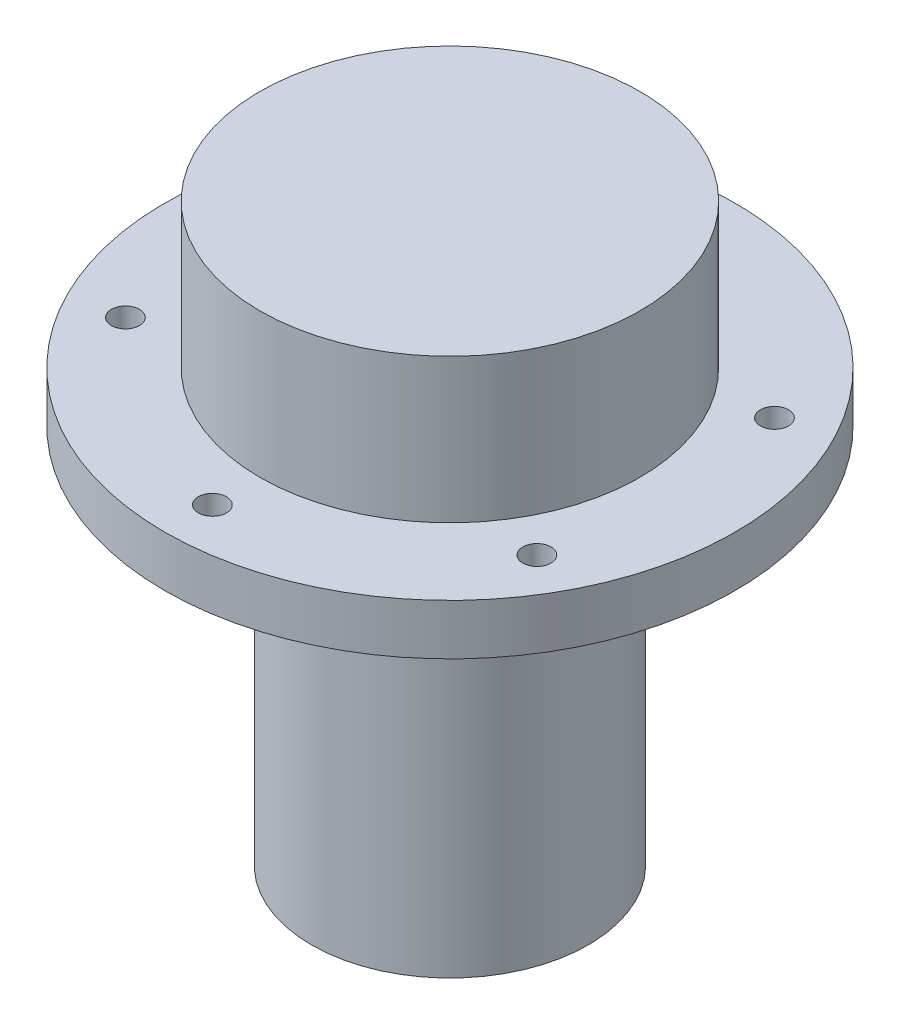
from build123d import *

# Parameters (mm, degrees)
SKETCH1_R     = 57.15
SKETCH1_R_2   = 27.7495
SKETCH1_R_3   = 2.8194
FLANGE_DEPTH  = 10.16
SKETCH2_R     = 27.7495
FLOAT_2_DEPTH = 76.2
SKETCH3_R     = 38.1
CAP_DEPTH     = 28.9052


with BuildPart() as part:
    # Sketch1 → Flange (new body)
    with BuildSketch(Plane(origin=(0, 0, 0), x_dir=(1, 0, 0), z_dir=(0, 1, 0))):
        with Locations(Location((0, 0, 0), (0, 0, 270))):
            Circle(SKETCH1_R)
        with Locations(Location((0, 0, 0), (0, 0, 270))):
            Circle(SKETCH1_R_2, mode=Mode.SUBTRACT)
        with Locations(Location((0, 47.625, 0), (0, 0, 270))):
            Circle(SKETCH1_R_3, mode=Mode.SUBTRACT)
        with Locations(Location((41.244459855, 23.8125, 0), (0, 0, 270))):
            Circle(SKETCH1_R_3, mode=Mode.SUBTRACT)
        with Locations(Location((41.244459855, -23.8125, 0), (0, 0, 270))):
            Circle(SKETCH1_R_3, mode=Mode.SUBTRACT)
        with Locations(Location((0, -47.625, 0), (0, 0, 270))):
            Circle(SKETCH1_R_3, mode=Mode.SUBTRACT)
        with Locations(Location((-41.244459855, -23.8125, 0), (0, 0, 270))):
            Circle(SKETCH1_R_3, mode=Mode.SUBTRACT)
        with Locations(Location((-41.244459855, 23.8125, 0), (0, 0, 270))):
            Circle(SKETCH1_R_3, mode=Mode.SUBTRACT)
    extrude(amount=FLANGE_DEPTH)

    # Sketch3 → Cap (add)
    with BuildSketch(Plane(origin=(0, 10.16, 0), x_dir=(1, 0, 0), z_dir=(0, 1, 0))):
        with Locations(Location((0, 0, 0), (0, 0, 270))):
            Circle(SKETCH3_R)
    extrude(amount=CAP_DEPTH)


with BuildPart() as body_2:
    # Sketch2 → Float 2 (new body)
    with BuildSketch(Plane(origin=(0, 0, 0), x_dir=(1, 0, 0), z_dir=(0, 1, 0))):
        with Locations(Location((0, 0, 0), (0, 0, 270))):
            Circle(SKETCH2_R)
    extrude(amount=-FLOAT_2_DEPTH)


solid = Compound([part.part, body_2.part])
